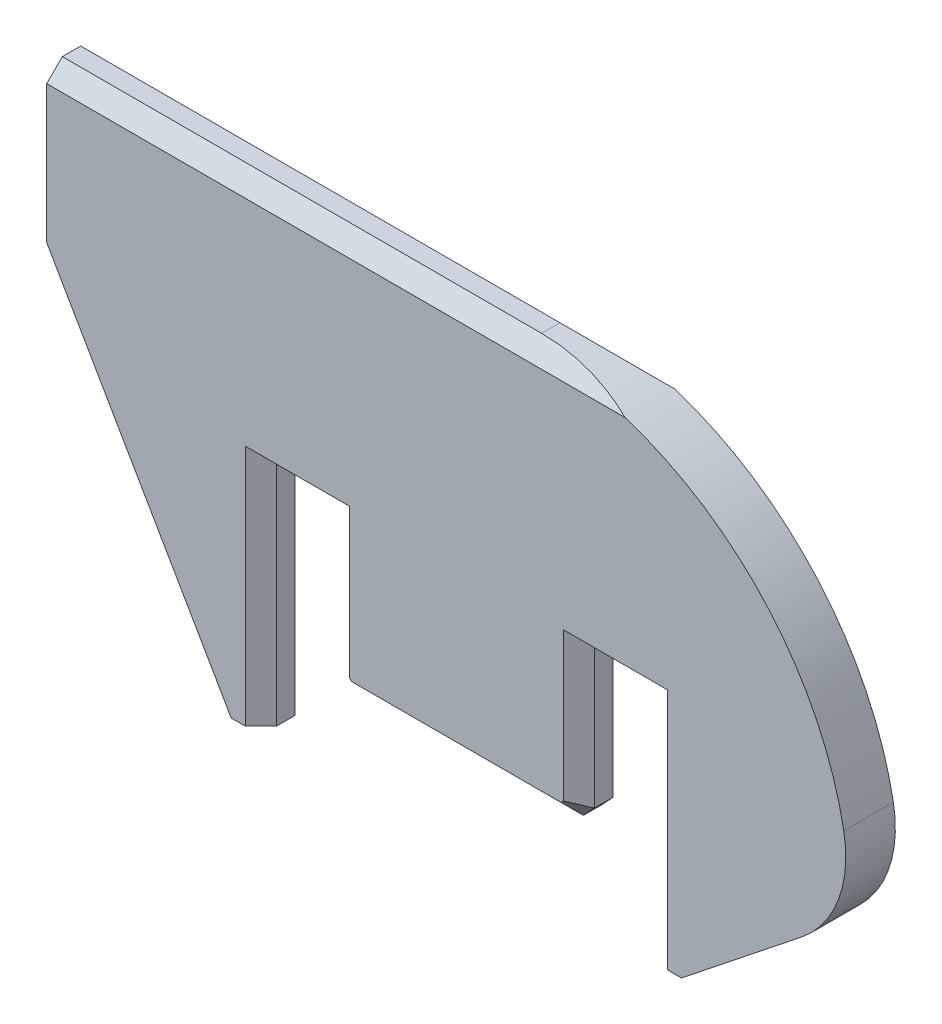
ISO-10303-21;
HEADER;
FILE_DESCRIPTION(('STEP AP214'),'2;1');
FILE_NAME('part.step','',(''),(''),'','','');
FILE_SCHEMA(('AUTOMOTIVE_DESIGN { 1 0 10303 214 1 1 1 1 }'));
ENDSEC;
DATA;
#1=APPLICATION_CONTEXT('core data for automotive mechanical design processes');
#2=APPLICATION_PROTOCOL_DEFINITION('international standard','automotive_design',2000,#1);
#3=PRODUCT_CONTEXT('',#1,'mechanical');
#4=PRODUCT('Part','Part','',(#3));
#5=PRODUCT_RELATED_PRODUCT_CATEGORY('part','',(#4));
#6=PRODUCT_DEFINITION_FORMATION('','',#4);
#7=PRODUCT_DEFINITION_CONTEXT('part definition',#1,'design');
#8=PRODUCT_DEFINITION('design','',#6,#7);
#9=PRODUCT_DEFINITION_SHAPE('','',#8);
#10=(LENGTH_UNIT() NAMED_UNIT(*) SI_UNIT(.MILLI.,.METRE.));
#11=(NAMED_UNIT(*) PLANE_ANGLE_UNIT() SI_UNIT($,.RADIAN.));
#12=(NAMED_UNIT(*) SI_UNIT($,.STERADIAN.) SOLID_ANGLE_UNIT());
#13=UNCERTAINTY_MEASURE_WITH_UNIT(LENGTH_MEASURE(1.E-05),#10,'distance_accuracy_value','');
#14=(GEOMETRIC_REPRESENTATION_CONTEXT(3) GLOBAL_UNCERTAINTY_ASSIGNED_CONTEXT((#13)) GLOBAL_UNIT_ASSIGNED_CONTEXT((#10,
#11,#12)) REPRESENTATION_CONTEXT('',''));
#15=CARTESIAN_POINT('',(0.,0.,0.));
#16=DIRECTION('',(0.,0.,1.));
#17=DIRECTION('',(1.,0.,0.));
#18=AXIS2_PLACEMENT_3D('',#15,#16,#17);
#19=CARTESIAN_POINT('',(-524.878159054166,320.,31.75));
#20=DIRECTION('',(0.,-1.,0.));
#21=DIRECTION('',(1.,0.,0.));
#22=AXIS2_PLACEMENT_3D('',#19,#20,#21);
#23=PLANE('',#22);
#24=DIRECTION('',(0.,0.,1.));
#25=VECTOR('',#24,1.);
#26=CARTESIAN_POINT('',(89.2619135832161,320.,-31.75));
#27=LINE('',#26,#25);
#28=CARTESIAN_POINT('',(89.2619135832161,320.,-11.75));
#29=VERTEX_POINT('',#28);
#30=CARTESIAN_POINT('',(89.2619135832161,320.,11.7499999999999));
#31=VERTEX_POINT('',#30);
#32=EDGE_CURVE('E496',#29,#31,#27,.T.);
#33=ORIENTED_EDGE('',*,*,#32,.F.);
#34=DIRECTION('',(-1.,0.,0.));
#35=VECTOR('',#34,1.);
#36=CARTESIAN_POINT('',(-524.878159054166,320.,-11.75));
#37=LINE('',#36,#35);
#38=CARTESIAN_POINT('',(-524.878159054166,320.,-11.75));
#39=VERTEX_POINT('',#38);
#40=EDGE_CURVE('E479',#29,#39,#37,.T.);
#41=ORIENTED_EDGE('',*,*,#40,.T.);
#42=DIRECTION('',(0.,0.,-1.));
#43=VECTOR('',#42,1.);
#44=CARTESIAN_POINT('',(-524.878159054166,320.,31.75));
#45=LINE('',#44,#43);
#46=CARTESIAN_POINT('',(-524.878159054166,320.,11.7499999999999));
#47=VERTEX_POINT('',#46);
#48=EDGE_CURVE('E506',#47,#39,#45,.T.);
#49=ORIENTED_EDGE('',*,*,#48,.F.);
#50=DIRECTION('',(1.,0.,0.));
#51=VECTOR('',#50,1.);
#52=CARTESIAN_POINT('',(-524.878159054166,320.,11.7499999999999));
#53=LINE('',#52,#51);
#54=EDGE_CURVE('E412',#47,#31,#53,.T.);
#55=ORIENTED_EDGE('',*,*,#54,.T.);
#56=EDGE_LOOP('',(#33,#41,#49,#55));
#57=FACE_BOUND('',#56,.T.);
#58=ADVANCED_FACE('F50',(#57),#23,.F.);
#59=CARTESIAN_POINT('',(0.,0.,31.75));
#60=DIRECTION('',(0.,0.,-1.));
#61=DIRECTION('',(-1.,0.,0.));
#62=AXIS2_PLACEMENT_3D('',#59,#60,#61);
#63=PLANE('',#62);
#64=CARTESIAN_POINT('',(89.2619135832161,-94.2455211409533,31.75));
#65=DIRECTION('',(0.,0.,-1.));
#66=DIRECTION('',(1.,0.,0.));
#67=AXIS2_PLACEMENT_3D('',#64,#65,#66);
#68=CIRCLE('',#67,414.245521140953);
#69=CARTESIAN_POINT('',(216.422524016,300.,31.75));
#70=VERTEX_POINT('',#69);
#71=CARTESIAN_POINT('',(496.537858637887,-18.5774541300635,31.75));
#72=VERTEX_POINT('',#71);
#73=EDGE_CURVE('E444',#70,#72,#68,.T.);
#74=ORIENTED_EDGE('',*,*,#73,.F.);
#75=DIRECTION('',(-1.,0.,0.));
#76=VECTOR('',#75,1.);
#77=CARTESIAN_POINT('',(0.,300.,31.75));
#78=LINE('',#77,#76);
#79=CARTESIAN_POINT('',(-524.878159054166,300.,31.75));
#80=VERTEX_POINT('',#79);
#81=EDGE_CURVE('E11',#70,#80,#78,.T.);
#82=ORIENTED_EDGE('',*,*,#81,.T.);
#83=DIRECTION('',(0.,-1.,0.));
#84=VECTOR('',#83,1.);
#85=CARTESIAN_POINT('',(-524.878159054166,320.,31.75));
#86=LINE('',#85,#84);
#87=CARTESIAN_POINT('',(-524.878159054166,123.60590948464,31.75));
#88=VERTEX_POINT('',#87);
#89=EDGE_CURVE('E241',#80,#88,#86,.T.);
#90=ORIENTED_EDGE('',*,*,#89,.T.);
#91=DIRECTION('',(0.500000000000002,-0.866025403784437,0.));
#92=VECTOR('',#91,1.);
#93=CARTESIAN_POINT('',(-288.496,-285.82,31.75));
#94=LINE('',#93,#92);
#95=CARTESIAN_POINT('',(-288.496,-285.82,31.75));
#96=VERTEX_POINT('',#95);
#97=EDGE_CURVE('E244',#88,#96,#94,.T.);
#98=ORIENTED_EDGE('',*,*,#97,.T.);
#99=DIRECTION('',(1.,0.,0.));
#100=VECTOR('',#99,1.);
#101=CARTESIAN_POINT('',(-250.396,-285.82,31.75));
#102=LINE('',#101,#100);
#103=CARTESIAN_POINT('',(-270.396,-285.82,31.75));
#104=VERTEX_POINT('',#103);
#105=EDGE_CURVE('E262',#96,#104,#102,.T.);
#106=ORIENTED_EDGE('',*,*,#105,.T.);
#107=DIRECTION('',(0.,1.,0.));
#108=VECTOR('',#107,1.);
#109=CARTESIAN_POINT('',(-270.396,0.,31.75));
#110=LINE('',#109,#108);
#111=CARTESIAN_POINT('',(-270.396,24.9999999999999,31.75));
#112=VERTEX_POINT('',#111);
#113=EDGE_CURVE('E389',#104,#112,#110,.T.);
#114=ORIENTED_EDGE('',*,*,#113,.T.);
#115=DIRECTION('',(1.,0.,0.));
#116=VECTOR('',#115,1.);
#117=CARTESIAN_POINT('',(0.,24.9999999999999,31.75));
#118=LINE('',#117,#116);
#119=CARTESIAN_POINT('',(-137.02,24.9999999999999,31.75));
#120=VERTEX_POINT('',#119);
#121=EDGE_CURVE('E384',#112,#120,#118,.T.);
#122=ORIENTED_EDGE('',*,*,#121,.T.);
#123=DIRECTION('',(0.,-1.,0.));
#124=VECTOR('',#123,1.);
#125=CARTESIAN_POINT('',(-137.02,0.,31.75));
#126=LINE('',#125,#124);
#127=CARTESIAN_POINT('',(-137.02,-165.0842563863,31.75));
#128=VERTEX_POINT('',#127);
#129=EDGE_CURVE('E388',#120,#128,#126,.T.);
#130=ORIENTED_EDGE('',*,*,#129,.T.);
#131=DIRECTION('',(0.682728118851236,-0.730672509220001,0.));
#132=VECTOR('',#131,1.);
#133=CARTESIAN_POINT('',(-155.504946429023,-145.301209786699,31.75));
#134=LINE('',#133,#132);
#135=CARTESIAN_POINT('',(-134.09562014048,-168.214,31.75));
#136=VERTEX_POINT('',#135);
#137=EDGE_CURVE('E395',#128,#136,#134,.T.);
#138=ORIENTED_EDGE('',*,*,#137,.T.);
#139=DIRECTION('',(1.,0.,0.));
#140=VECTOR('',#139,1.);
#141=CARTESIAN_POINT('',(0.,-168.214,31.75));
#142=LINE('',#141,#140);
#143=CARTESIAN_POINT('',(134.09562014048,-168.214,31.75));
#144=VERTEX_POINT('',#143);
#145=EDGE_CURVE('E391',#136,#144,#142,.T.);
#146=ORIENTED_EDGE('',*,*,#145,.T.);
#147=DIRECTION('',(0.682728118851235,0.730672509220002,0.));
#148=VECTOR('',#147,1.);
#149=CARTESIAN_POINT('',(155.504946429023,-145.301209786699,31.75));
#150=LINE('',#149,#148);
#151=CARTESIAN_POINT('',(137.02,-165.0842563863,31.75));
#152=VERTEX_POINT('',#151);
#153=EDGE_CURVE('E400',#144,#152,#150,.T.);
#154=ORIENTED_EDGE('',*,*,#153,.T.);
#155=DIRECTION('',(0.,1.,0.));
#156=VECTOR('',#155,1.);
#157=CARTESIAN_POINT('',(137.02,0.,31.75));
#158=LINE('',#157,#156);
#159=CARTESIAN_POINT('',(137.02,25.,31.75));
#160=VERTEX_POINT('',#159);
#161=EDGE_CURVE('E402',#152,#160,#158,.T.);
#162=ORIENTED_EDGE('',*,*,#161,.T.);
#163=DIRECTION('',(1.,0.,0.));
#164=VECTOR('',#163,1.);
#165=CARTESIAN_POINT('',(0.,24.9999999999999,31.75));
#166=LINE('',#165,#164);
#167=CARTESIAN_POINT('',(270.396,25.,31.75));
#168=VERTEX_POINT('',#167);
#169=EDGE_CURVE('E404',#160,#168,#166,.T.);
#170=ORIENTED_EDGE('',*,*,#169,.T.);
#171=DIRECTION('',(0.,-1.,0.));
#172=VECTOR('',#171,1.);
#173=CARTESIAN_POINT('',(270.396,0.,31.75));
#174=LINE('',#173,#172);
#175=CARTESIAN_POINT('',(270.396,-285.82,31.75));
#176=VERTEX_POINT('',#175);
#177=EDGE_CURVE('E406',#168,#176,#174,.T.);
#178=ORIENTED_EDGE('',*,*,#177,.T.);
#179=DIRECTION('',(1.,0.,0.));
#180=VECTOR('',#179,1.);
#181=CARTESIAN_POINT('',(250.396,-285.82,31.75));
#182=LINE('',#181,#180);
#183=CARTESIAN_POINT('',(288.496,-285.82,31.75));
#184=VERTEX_POINT('',#183);
#185=EDGE_CURVE('E620',#176,#184,#182,.T.);
#186=ORIENTED_EDGE('',*,*,#185,.T.);
#187=DIRECTION('',(0.782608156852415,0.622514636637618,0.));
#188=VECTOR('',#187,1.);
#189=CARTESIAN_POINT('',(288.496,-285.82,31.75));
#190=LINE('',#189,#188);
#191=CARTESIAN_POINT('',(442.438766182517,-163.368394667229,31.75));
#192=VERTEX_POINT('',#191);
#193=EDGE_CURVE('E519',#184,#192,#190,.T.);
#194=ORIENTED_EDGE('',*,*,#193,.T.);
#195=CARTESIAN_POINT('',(349.061570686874,-45.9771711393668,31.75));
#196=DIRECTION('',(0.,0.,-1.));
#197=DIRECTION('',(-1.,0.,0.));
#198=AXIS2_PLACEMENT_3D('',#195,#196,#197);
#199=CIRCLE('',#198,150.);
#200=EDGE_CURVE('E271',#192,#72,#199,.F.);
#201=ORIENTED_EDGE('',*,*,#200,.T.);
#202=EDGE_LOOP('',(#74,#82,#90,#98,#106,#114,#122,#130,#138,#146,#154,#162,#170,#178,#186,#194,#201));
#203=FACE_BOUND('',#202,.T.);
#204=ADVANCED_FACE('F243',(#203),#63,.F.);
#205=CARTESIAN_POINT('',(0.,0.,-31.75));
#206=DIRECTION('',(0.,0.,-1.));
#207=DIRECTION('',(-1.,0.,0.));
#208=AXIS2_PLACEMENT_3D('',#205,#206,#207);
#209=PLANE('',#208);
#210=DIRECTION('',(0.,-1.,0.));
#211=VECTOR('',#210,1.);
#212=CARTESIAN_POINT('',(-524.878159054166,320.,-31.75));
#213=LINE('',#212,#211);
#214=CARTESIAN_POINT('',(-524.878159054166,300.,-31.75));
#215=VERTEX_POINT('',#214);
#216=CARTESIAN_POINT('',(-524.878159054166,123.60590948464,-31.75));
#217=VERTEX_POINT('',#216);
#218=EDGE_CURVE('E261',#215,#217,#213,.T.);
#219=ORIENTED_EDGE('',*,*,#218,.F.);
#220=DIRECTION('',(1.,0.,0.));
#221=VECTOR('',#220,1.);
#222=CARTESIAN_POINT('',(89.2619135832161,300.,-31.75));
#223=LINE('',#222,#221);
#224=CARTESIAN_POINT('',(216.422524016,300.,-31.75));
#225=VERTEX_POINT('',#224);
#226=EDGE_CURVE('E74',#215,#225,#223,.T.);
#227=ORIENTED_EDGE('',*,*,#226,.T.);
#228=CARTESIAN_POINT('',(89.2619135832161,-94.2455211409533,-31.75));
#229=DIRECTION('',(0.,0.,-1.));
#230=DIRECTION('',(1.,0.,0.));
#231=AXIS2_PLACEMENT_3D('',#228,#229,#230);
#232=CIRCLE('',#231,414.245521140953);
#233=CARTESIAN_POINT('',(496.537858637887,-18.5774541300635,-31.75));
#234=VERTEX_POINT('',#233);
#235=EDGE_CURVE('E500',#225,#234,#232,.T.);
#236=ORIENTED_EDGE('',*,*,#235,.T.);
#237=CARTESIAN_POINT('',(349.061570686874,-45.9771711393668,-31.75));
#238=DIRECTION('',(0.,0.,-1.));
#239=DIRECTION('',(-1.,0.,0.));
#240=AXIS2_PLACEMENT_3D('',#237,#238,#239);
#241=CIRCLE('',#240,150.);
#242=CARTESIAN_POINT('',(442.438766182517,-163.368394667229,-31.75));
#243=VERTEX_POINT('',#242);
#244=EDGE_CURVE('E287',#234,#243,#241,.T.);
#245=ORIENTED_EDGE('',*,*,#244,.T.);
#246=DIRECTION('',(0.782608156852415,0.622514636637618,0.));
#247=VECTOR('',#246,1.);
#248=CARTESIAN_POINT('',(288.496,-285.82,-31.75));
#249=LINE('',#248,#247);
#250=CARTESIAN_POINT('',(288.496,-285.82,-31.75));
#251=VERTEX_POINT('',#250);
#252=EDGE_CURVE('E252',#251,#243,#249,.T.);
#253=ORIENTED_EDGE('',*,*,#252,.F.);
#254=DIRECTION('',(1.,0.,0.));
#255=VECTOR('',#254,1.);
#256=CARTESIAN_POINT('',(250.396,-285.82,-31.75));
#257=LINE('',#256,#255);
#258=CARTESIAN_POINT('',(270.396,-285.82,-31.75));
#259=VERTEX_POINT('',#258);
#260=EDGE_CURVE('E525',#259,#251,#257,.T.);
#261=ORIENTED_EDGE('',*,*,#260,.F.);
#262=DIRECTION('',(0.,1.,0.));
#263=VECTOR('',#262,1.);
#264=CARTESIAN_POINT('',(270.396,5.00000000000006,-31.75));
#265=LINE('',#264,#263);
#266=CARTESIAN_POINT('',(270.396,25.0000000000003,-31.75));
#267=VERTEX_POINT('',#266);
#268=EDGE_CURVE('E327',#259,#267,#265,.T.);
#269=ORIENTED_EDGE('',*,*,#268,.T.);
#270=DIRECTION('',(-1.,0.,0.));
#271=VECTOR('',#270,1.);
#272=CARTESIAN_POINT('',(157.02,25.0000000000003,-31.75));
#273=LINE('',#272,#271);
#274=CARTESIAN_POINT('',(137.02,25.0000000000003,-31.75));
#275=VERTEX_POINT('',#274);
#276=EDGE_CURVE('E325',#267,#275,#273,.T.);
#277=ORIENTED_EDGE('',*,*,#276,.T.);
#278=DIRECTION('',(0.,-1.,0.));
#279=VECTOR('',#278,1.);
#280=CARTESIAN_POINT('',(137.02,-172.974,-31.75));
#281=LINE('',#280,#279);
#282=CARTESIAN_POINT('',(137.02,-165.0842563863,-31.75));
#283=VERTEX_POINT('',#282);
#284=EDGE_CURVE('E318',#275,#283,#281,.T.);
#285=ORIENTED_EDGE('',*,*,#284,.T.);
#286=DIRECTION('',(-0.682728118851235,-0.730672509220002,0.));
#287=VECTOR('',#286,1.);
#288=CARTESIAN_POINT('',(128.1665498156,-174.559437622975,-31.75));
#289=LINE('',#288,#287);
#290=CARTESIAN_POINT('',(134.09562014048,-168.214,-31.75));
#291=VERTEX_POINT('',#290);
#292=EDGE_CURVE('E320',#283,#291,#289,.T.);
#293=ORIENTED_EDGE('',*,*,#292,.T.);
#294=DIRECTION('',(-1.,0.,0.));
#295=VECTOR('',#294,1.);
#296=CARTESIAN_POINT('',(-142.78,-168.214,-31.75));
#297=LINE('',#296,#295);
#298=CARTESIAN_POINT('',(-134.09562014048,-168.214,-31.75));
#299=VERTEX_POINT('',#298);
#300=EDGE_CURVE('E313',#291,#299,#297,.T.);
#301=ORIENTED_EDGE('',*,*,#300,.T.);
#302=DIRECTION('',(-0.682728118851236,0.730672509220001,0.));
#303=VECTOR('',#302,1.);
#304=CARTESIAN_POINT('',(-142.4065498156,-159.319437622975,-31.75));
#305=LINE('',#304,#303);
#306=CARTESIAN_POINT('',(-137.02,-165.0842563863,-31.75));
#307=VERTEX_POINT('',#306);
#308=EDGE_CURVE('E311',#299,#307,#305,.T.);
#309=ORIENTED_EDGE('',*,*,#308,.T.);
#310=DIRECTION('',(0.,1.,0.));
#311=VECTOR('',#310,1.);
#312=CARTESIAN_POINT('',(-137.02,5.,-31.75));
#313=LINE('',#312,#311);
#314=CARTESIAN_POINT('',(-137.02,25.0000000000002,-31.75));
#315=VERTEX_POINT('',#314);
#316=EDGE_CURVE('E308',#307,#315,#313,.T.);
#317=ORIENTED_EDGE('',*,*,#316,.T.);
#318=DIRECTION('',(-1.,0.,0.));
#319=VECTOR('',#318,1.);
#320=CARTESIAN_POINT('',(-250.396,25.0000000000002,-31.75));
#321=LINE('',#320,#319);
#322=CARTESIAN_POINT('',(-270.396,25.0000000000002,-31.75));
#323=VERTEX_POINT('',#322);
#324=EDGE_CURVE('E304',#315,#323,#321,.T.);
#325=ORIENTED_EDGE('',*,*,#324,.T.);
#326=DIRECTION('',(0.,-1.,0.));
#327=VECTOR('',#326,1.);
#328=CARTESIAN_POINT('',(-270.396,-285.82,-31.75));
#329=LINE('',#328,#327);
#330=CARTESIAN_POINT('',(-270.396,-285.82,-31.75));
#331=VERTEX_POINT('',#330);
#332=EDGE_CURVE('E305',#323,#331,#329,.T.);
#333=ORIENTED_EDGE('',*,*,#332,.T.);
#334=DIRECTION('',(1.,0.,0.));
#335=VECTOR('',#334,1.);
#336=CARTESIAN_POINT('',(-250.396,-285.82,-31.75));
#337=LINE('',#336,#335);
#338=CARTESIAN_POINT('',(-288.496,-285.82,-31.75));
#339=VERTEX_POINT('',#338);
#340=EDGE_CURVE('E514',#339,#331,#337,.T.);
#341=ORIENTED_EDGE('',*,*,#340,.F.);
#342=DIRECTION('',(0.500000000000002,-0.866025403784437,0.));
#343=VECTOR('',#342,1.);
#344=CARTESIAN_POINT('',(-288.496,-285.82,-31.75));
#345=LINE('',#344,#343);
#346=EDGE_CURVE('E508',#217,#339,#345,.T.);
#347=ORIENTED_EDGE('',*,*,#346,.F.);
#348=EDGE_LOOP('',(#219,#227,#236,#245,#253,#261,#269,#277,#285,#293,#301,#309,#317,#325,#333,
#341,#347));
#349=FACE_BOUND('',#348,.T.);
#350=ADVANCED_FACE('F510',(#349),#209,.T.);
#351=CARTESIAN_POINT('',(-524.878159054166,320.,31.75));
#352=DIRECTION('',(1.,0.,0.));
#353=DIRECTION('',(0.,0.,-1.));
#354=AXIS2_PLACEMENT_3D('',#351,#352,#353);
#355=PLANE('',#354);
#356=ORIENTED_EDGE('',*,*,#48,.T.);
#357=DIRECTION('',(0.,-0.70710678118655,-0.707106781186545));
#358=VECTOR('',#357,1.);
#359=CARTESIAN_POINT('',(-524.878159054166,320.,-11.75));
#360=LINE('',#359,#358);
#361=EDGE_CURVE('E488',#39,#215,#360,.T.);
#362=ORIENTED_EDGE('',*,*,#361,.T.);
#363=ORIENTED_EDGE('',*,*,#218,.T.);
#364=DIRECTION('',(0.,0.,-1.));
#365=VECTOR('',#364,1.);
#366=CARTESIAN_POINT('',(-524.878159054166,123.60590948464,31.75));
#367=LINE('',#366,#365);
#368=EDGE_CURVE('E259',#88,#217,#367,.T.);
#369=ORIENTED_EDGE('',*,*,#368,.F.);
#370=ORIENTED_EDGE('',*,*,#89,.F.);
#371=DIRECTION('',(0.,-0.707106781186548,0.707106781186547));
#372=VECTOR('',#371,1.);
#373=CARTESIAN_POINT('',(-524.878159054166,300.,31.75));
#374=LINE('',#373,#372);
#375=EDGE_CURVE('E485',#80,#47,#374,.F.);
#376=ORIENTED_EDGE('',*,*,#375,.T.);
#377=EDGE_LOOP('',(#356,#362,#363,#369,#370,#376));
#378=FACE_BOUND('',#377,.T.);
#379=ADVANCED_FACE('F264',(#378),#355,.F.);
#380=CARTESIAN_POINT('',(-288.496,-285.82,31.75));
#381=DIRECTION('',(0.866025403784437,0.500000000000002,0.));
#382=DIRECTION('',(-0.500000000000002,0.866025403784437,0.));
#383=AXIS2_PLACEMENT_3D('',#380,#381,#382);
#384=PLANE('',#383);
#385=ORIENTED_EDGE('',*,*,#346,.T.);
#386=DIRECTION('',(0.,0.,-1.));
#387=VECTOR('',#386,1.);
#388=CARTESIAN_POINT('',(-288.496,-285.82,31.75));
#389=LINE('',#388,#387);
#390=EDGE_CURVE('E260',#96,#339,#389,.T.);
#391=ORIENTED_EDGE('',*,*,#390,.F.);
#392=ORIENTED_EDGE('',*,*,#97,.F.);
#393=ORIENTED_EDGE('',*,*,#368,.T.);
#394=EDGE_LOOP('',(#385,#391,#392,#393));
#395=FACE_BOUND('',#394,.T.);
#396=ADVANCED_FACE('F253',(#395),#384,.F.);
#397=CARTESIAN_POINT('',(-250.396,-285.82,31.75));
#398=DIRECTION('',(0.,1.,0.));
#399=DIRECTION('',(0.,0.,1.));
#400=AXIS2_PLACEMENT_3D('',#397,#398,#399);
#401=PLANE('',#400);
#402=ORIENTED_EDGE('',*,*,#340,.T.);
#403=DIRECTION('',(0.707106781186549,0.,0.707106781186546));
#404=VECTOR('',#403,1.);
#405=CARTESIAN_POINT('',(-250.396,-285.82,-11.7499999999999));
#406=LINE('',#405,#404);
#407=CARTESIAN_POINT('',(-250.396,-285.82,-11.7499999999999));
#408=VERTEX_POINT('',#407);
#409=EDGE_CURVE('E379',#331,#408,#406,.T.);
#410=ORIENTED_EDGE('',*,*,#409,.T.);
#411=DIRECTION('',(0.,0.,-1.));
#412=VECTOR('',#411,1.);
#413=CARTESIAN_POINT('',(-250.396,-285.82,31.75));
#414=LINE('',#413,#412);
#415=CARTESIAN_POINT('',(-250.396,-285.82,11.7500000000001));
#416=VERTEX_POINT('',#415);
#417=EDGE_CURVE('E273',#416,#408,#414,.T.);
#418=ORIENTED_EDGE('',*,*,#417,.F.);
#419=DIRECTION('',(0.707106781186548,0.,-0.707106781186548));
#420=VECTOR('',#419,1.);
#421=CARTESIAN_POINT('',(-270.396,-285.82,31.75));
#422=LINE('',#421,#420);
#423=EDGE_CURVE('E380',#416,#104,#422,.F.);
#424=ORIENTED_EDGE('',*,*,#423,.T.);
#425=ORIENTED_EDGE('',*,*,#105,.F.);
#426=ORIENTED_EDGE('',*,*,#390,.T.);
#427=EDGE_LOOP('',(#402,#410,#418,#424,#425,#426));
#428=FACE_BOUND('',#427,.T.);
#429=ADVANCED_FACE('F617',(#428),#401,.F.);
#430=CARTESIAN_POINT('',(-250.396,-285.82,31.75));
#431=DIRECTION('',(-1.,0.,0.));
#432=DIRECTION('',(0.,0.,1.));
#433=AXIS2_PLACEMENT_3D('',#430,#431,#432);
#434=PLANE('',#433);
#435=ORIENTED_EDGE('',*,*,#417,.T.);
#436=DIRECTION('',(0.,1.,0.));
#437=VECTOR('',#436,1.);
#438=CARTESIAN_POINT('',(-250.396,5.,-11.7499999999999));
#439=LINE('',#438,#437);
#440=CARTESIAN_POINT('',(-250.396,5.,-11.7499999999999));
#441=VERTEX_POINT('',#440);
#442=EDGE_CURVE('E372',#408,#441,#439,.T.);
#443=ORIENTED_EDGE('',*,*,#442,.T.);
#444=DIRECTION('',(0.,0.,-1.));
#445=VECTOR('',#444,1.);
#446=CARTESIAN_POINT('',(-250.396,5.,31.75));
#447=LINE('',#446,#445);
#448=CARTESIAN_POINT('',(-250.396,5.,11.7500000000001));
#449=VERTEX_POINT('',#448);
#450=EDGE_CURVE('E566',#449,#441,#447,.T.);
#451=ORIENTED_EDGE('',*,*,#450,.F.);
#452=DIRECTION('',(0.,-1.,0.));
#453=VECTOR('',#452,1.);
#454=CARTESIAN_POINT('',(-250.396,-285.82,11.7500000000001));
#455=LINE('',#454,#453);
#456=EDGE_CURVE('E371',#449,#416,#455,.T.);
#457=ORIENTED_EDGE('',*,*,#456,.T.);
#458=EDGE_LOOP('',(#435,#443,#451,#457));
#459=FACE_BOUND('',#458,.T.);
#460=ADVANCED_FACE('F573',(#459),#434,.F.);
#461=CARTESIAN_POINT('',(-250.396,5.,31.75));
#462=DIRECTION('',(0.,1.,0.));
#463=DIRECTION('',(0.,0.,1.));
#464=AXIS2_PLACEMENT_3D('',#461,#462,#463);
#465=PLANE('',#464);
#466=ORIENTED_EDGE('',*,*,#450,.T.);
#467=DIRECTION('',(1.,0.,0.));
#468=VECTOR('',#467,1.);
#469=CARTESIAN_POINT('',(-157.02,5.,-11.7499999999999));
#470=LINE('',#469,#468);
#471=CARTESIAN_POINT('',(-157.02,5.,-11.7499999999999));
#472=VERTEX_POINT('',#471);
#473=EDGE_CURVE('E368',#441,#472,#470,.T.);
#474=ORIENTED_EDGE('',*,*,#473,.T.);
#475=DIRECTION('',(0.,0.,-1.));
#476=VECTOR('',#475,1.);
#477=CARTESIAN_POINT('',(-157.02,5.,31.75));
#478=LINE('',#477,#476);
#479=CARTESIAN_POINT('',(-157.02,5.,11.7500000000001));
#480=VERTEX_POINT('',#479);
#481=EDGE_CURVE('E565',#480,#472,#478,.T.);
#482=ORIENTED_EDGE('',*,*,#481,.F.);
#483=DIRECTION('',(-1.,0.,0.));
#484=VECTOR('',#483,1.);
#485=CARTESIAN_POINT('',(-250.396,5.,11.7500000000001));
#486=LINE('',#485,#484);
#487=EDGE_CURVE('E362',#480,#449,#486,.T.);
#488=ORIENTED_EDGE('',*,*,#487,.T.);
#489=EDGE_LOOP('',(#466,#474,#482,#488));
#490=FACE_BOUND('',#489,.T.);
#491=ADVANCED_FACE('F594',(#490),#465,.F.);
#492=CARTESIAN_POINT('',(-157.02,-172.974,31.75));
#493=DIRECTION('',(1.,0.,0.));
#494=DIRECTION('',(0.,0.,-1.));
#495=AXIS2_PLACEMENT_3D('',#492,#493,#494);
#496=PLANE('',#495);
#497=ORIENTED_EDGE('',*,*,#481,.T.);
#498=DIRECTION('',(0.,-1.,0.));
#499=VECTOR('',#498,1.);
#500=CARTESIAN_POINT('',(-157.02,-172.974,-11.7499999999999));
#501=LINE('',#500,#499);
#502=CARTESIAN_POINT('',(-157.02,-172.974,-11.7499999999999));
#503=VERTEX_POINT('',#502);
#504=EDGE_CURVE('E365',#472,#503,#501,.T.);
#505=ORIENTED_EDGE('',*,*,#504,.T.);
#506=DIRECTION('',(0.,0.,-1.));
#507=VECTOR('',#506,1.);
#508=CARTESIAN_POINT('',(-157.02,-172.974,31.75));
#509=LINE('',#508,#507);
#510=CARTESIAN_POINT('',(-157.02,-172.974,11.7500000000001));
#511=VERTEX_POINT('',#510);
#512=EDGE_CURVE('E556',#511,#503,#509,.T.);
#513=ORIENTED_EDGE('',*,*,#512,.F.);
#514=DIRECTION('',(0.,1.,0.));
#515=VECTOR('',#514,1.);
#516=CARTESIAN_POINT('',(-157.02,-172.974,11.7500000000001));
#517=LINE('',#516,#515);
#518=EDGE_CURVE('E360',#511,#480,#517,.T.);
#519=ORIENTED_EDGE('',*,*,#518,.T.);
#520=EDGE_LOOP('',(#497,#505,#513,#519));
#521=FACE_BOUND('',#520,.T.);
#522=ADVANCED_FACE('F593',(#521),#496,.F.);
#523=CARTESIAN_POINT('',(-157.02,-172.974,31.75));
#524=DIRECTION('',(0.730672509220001,0.682728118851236,0.));
#525=DIRECTION('',(-0.682728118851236,0.730672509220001,0.));
#526=AXIS2_PLACEMENT_3D('',#523,#524,#525);
#527=PLANE('',#526);
#528=ORIENTED_EDGE('',*,*,#512,.T.);
#529=DIRECTION('',(0.682728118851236,-0.730672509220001,0.));
#530=VECTOR('',#529,1.);
#531=CARTESIAN_POINT('',(-142.78,-188.214,-11.7499999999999));
#532=LINE('',#531,#530);
#533=CARTESIAN_POINT('',(-142.78,-188.214,-11.7499999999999));
#534=VERTEX_POINT('',#533);
#535=EDGE_CURVE('E358',#503,#534,#532,.T.);
#536=ORIENTED_EDGE('',*,*,#535,.T.);
#537=DIRECTION('',(0.,0.,-1.));
#538=VECTOR('',#537,1.);
#539=CARTESIAN_POINT('',(-142.78,-188.214,31.75));
#540=LINE('',#539,#538);
#541=CARTESIAN_POINT('',(-142.78,-188.214,11.7500000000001));
#542=VERTEX_POINT('',#541);
#543=EDGE_CURVE('E555',#542,#534,#540,.T.);
#544=ORIENTED_EDGE('',*,*,#543,.F.);
#545=DIRECTION('',(-0.682728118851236,0.730672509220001,0.));
#546=VECTOR('',#545,1.);
#547=CARTESIAN_POINT('',(-157.02,-172.974,11.7500000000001));
#548=LINE('',#547,#546);
#549=EDGE_CURVE('E355',#542,#511,#548,.T.);
#550=ORIENTED_EDGE('',*,*,#549,.T.);
#551=EDGE_LOOP('',(#528,#536,#544,#550));
#552=FACE_BOUND('',#551,.T.);
#553=ADVANCED_FACE('F712',(#552),#527,.F.);
#554=CARTESIAN_POINT('',(-142.78,-188.214,31.75));
#555=DIRECTION('',(0.,1.,0.));
#556=DIRECTION('',(0.,0.,1.));
#557=AXIS2_PLACEMENT_3D('',#554,#555,#556);
#558=PLANE('',#557);
#559=ORIENTED_EDGE('',*,*,#543,.T.);
#560=DIRECTION('',(1.,0.,0.));
#561=VECTOR('',#560,1.);
#562=CARTESIAN_POINT('',(142.78,-188.214,-11.7499999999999));
#563=LINE('',#562,#561);
#564=CARTESIAN_POINT('',(142.78,-188.214,-11.7499999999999));
#565=VERTEX_POINT('',#564);
#566=EDGE_CURVE('E346',#534,#565,#563,.T.);
#567=ORIENTED_EDGE('',*,*,#566,.T.);
#568=DIRECTION('',(0.,0.,-1.));
#569=VECTOR('',#568,1.);
#570=CARTESIAN_POINT('',(142.78,-188.214,31.75));
#571=LINE('',#570,#569);
#572=CARTESIAN_POINT('',(142.78,-188.214,11.7500000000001));
#573=VERTEX_POINT('',#572);
#574=EDGE_CURVE('E548',#573,#565,#571,.T.);
#575=ORIENTED_EDGE('',*,*,#574,.F.);
#576=DIRECTION('',(-1.,0.,0.));
#577=VECTOR('',#576,1.);
#578=CARTESIAN_POINT('',(-142.78,-188.214,11.7500000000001));
#579=LINE('',#578,#577);
#580=EDGE_CURVE('E350',#573,#542,#579,.T.);
#581=ORIENTED_EDGE('',*,*,#580,.T.);
#582=EDGE_LOOP('',(#559,#567,#575,#581));
#583=FACE_BOUND('',#582,.T.);
#584=ADVANCED_FACE('F714',(#583),#558,.F.);
#585=CARTESIAN_POINT('',(157.02,-172.974,31.75));
#586=DIRECTION('',(-0.730672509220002,0.682728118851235,0.));
#587=DIRECTION('',(-0.682728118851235,-0.730672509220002,0.));
#588=AXIS2_PLACEMENT_3D('',#585,#586,#587);
#589=PLANE('',#588);
#590=ORIENTED_EDGE('',*,*,#574,.T.);
#591=DIRECTION('',(0.682728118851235,0.730672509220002,0.));
#592=VECTOR('',#591,1.);
#593=CARTESIAN_POINT('',(157.02,-172.974,-11.7499999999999));
#594=LINE('',#593,#592);
#595=CARTESIAN_POINT('',(157.02,-172.974,-11.7499999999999));
#596=VERTEX_POINT('',#595);
#597=EDGE_CURVE('E343',#565,#596,#594,.T.);
#598=ORIENTED_EDGE('',*,*,#597,.T.);
#599=DIRECTION('',(0.,0.,-1.));
#600=VECTOR('',#599,1.);
#601=CARTESIAN_POINT('',(157.02,-172.974,31.75));
#602=LINE('',#601,#600);
#603=CARTESIAN_POINT('',(157.02,-172.974,11.7500000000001));
#604=VERTEX_POINT('',#603);
#605=EDGE_CURVE('E547',#604,#596,#602,.T.);
#606=ORIENTED_EDGE('',*,*,#605,.F.);
#607=DIRECTION('',(-0.682728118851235,-0.730672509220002,0.));
#608=VECTOR('',#607,1.);
#609=CARTESIAN_POINT('',(157.02,-172.974,11.7500000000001));
#610=LINE('',#609,#608);
#611=EDGE_CURVE('E344',#604,#573,#610,.T.);
#612=ORIENTED_EDGE('',*,*,#611,.T.);
#613=EDGE_LOOP('',(#590,#598,#606,#612));
#614=FACE_BOUND('',#613,.T.);
#615=ADVANCED_FACE('F710',(#614),#589,.F.);
#616=CARTESIAN_POINT('',(157.02,5.00000000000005,31.75));
#617=DIRECTION('',(-1.,0.,0.));
#618=DIRECTION('',(0.,-1.,0.));
#619=AXIS2_PLACEMENT_3D('',#616,#617,#618);
#620=PLANE('',#619);
#621=ORIENTED_EDGE('',*,*,#605,.T.);
#622=DIRECTION('',(0.,1.,0.));
#623=VECTOR('',#622,1.);
#624=CARTESIAN_POINT('',(157.02,5.00000000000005,-11.7499999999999));
#625=LINE('',#624,#623);
#626=CARTESIAN_POINT('',(157.02,5.00000000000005,-11.7499999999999));
#627=VERTEX_POINT('',#626);
#628=EDGE_CURVE('E336',#596,#627,#625,.T.);
#629=ORIENTED_EDGE('',*,*,#628,.T.);
#630=DIRECTION('',(0.,0.,-1.));
#631=VECTOR('',#630,1.);
#632=CARTESIAN_POINT('',(157.02,5.00000000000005,31.75));
#633=LINE('',#632,#631);
#634=CARTESIAN_POINT('',(157.02,5.00000000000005,11.7500000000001));
#635=VERTEX_POINT('',#634);
#636=EDGE_CURVE('E545',#635,#627,#633,.T.);
#637=ORIENTED_EDGE('',*,*,#636,.F.);
#638=DIRECTION('',(0.,-1.,0.));
#639=VECTOR('',#638,1.);
#640=CARTESIAN_POINT('',(157.02,5.00000000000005,11.7500000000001));
#641=LINE('',#640,#639);
#642=EDGE_CURVE('E333',#635,#604,#641,.T.);
#643=ORIENTED_EDGE('',*,*,#642,.T.);
#644=EDGE_LOOP('',(#621,#629,#637,#643));
#645=FACE_BOUND('',#644,.T.);
#646=ADVANCED_FACE('F702',(#645),#620,.F.);
#647=CARTESIAN_POINT('',(157.02,5.00000000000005,31.75));
#648=DIRECTION('',(0.,1.,0.));
#649=DIRECTION('',(-1.,0.,0.));
#650=AXIS2_PLACEMENT_3D('',#647,#648,#649);
#651=PLANE('',#650);
#652=ORIENTED_EDGE('',*,*,#636,.T.);
#653=DIRECTION('',(1.,0.,0.));
#654=VECTOR('',#653,1.);
#655=CARTESIAN_POINT('',(250.396,5.00000000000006,-11.7499999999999));
#656=LINE('',#655,#654);
#657=CARTESIAN_POINT('',(250.396,5.00000000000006,-11.7499999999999));
#658=VERTEX_POINT('',#657);
#659=EDGE_CURVE('E334',#627,#658,#656,.T.);
#660=ORIENTED_EDGE('',*,*,#659,.T.);
#661=DIRECTION('',(0.,0.,-1.));
#662=VECTOR('',#661,1.);
#663=CARTESIAN_POINT('',(250.396,5.00000000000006,31.75));
#664=LINE('',#663,#662);
#665=CARTESIAN_POINT('',(250.396,5.00000000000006,11.7500000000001));
#666=VERTEX_POINT('',#665);
#667=EDGE_CURVE('E540',#666,#658,#664,.T.);
#668=ORIENTED_EDGE('',*,*,#667,.F.);
#669=DIRECTION('',(-1.,0.,0.));
#670=VECTOR('',#669,1.);
#671=CARTESIAN_POINT('',(157.02,5.00000000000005,11.7500000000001));
#672=LINE('',#671,#670);
#673=EDGE_CURVE('E329',#666,#635,#672,.T.);
#674=ORIENTED_EDGE('',*,*,#673,.T.);
#675=EDGE_LOOP('',(#652,#660,#668,#674));
#676=FACE_BOUND('',#675,.T.);
#677=ADVANCED_FACE('F697',(#676),#651,.F.);
#678=CARTESIAN_POINT('',(250.396,-285.82,31.75));
#679=DIRECTION('',(1.,0.,0.));
#680=DIRECTION('',(0.,0.,-1.));
#681=AXIS2_PLACEMENT_3D('',#678,#679,#680);
#682=PLANE('',#681);
#683=ORIENTED_EDGE('',*,*,#667,.T.);
#684=DIRECTION('',(0.,-1.,0.));
#685=VECTOR('',#684,1.);
#686=CARTESIAN_POINT('',(250.396,-285.82,-11.7499999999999));
#687=LINE('',#686,#685);
#688=CARTESIAN_POINT('',(250.396,-285.82,-11.7499999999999));
#689=VERTEX_POINT('',#688);
#690=EDGE_CURVE('E292',#658,#689,#687,.T.);
#691=ORIENTED_EDGE('',*,*,#690,.T.);
#692=DIRECTION('',(0.,0.,-1.));
#693=VECTOR('',#692,1.);
#694=CARTESIAN_POINT('',(250.396,-285.82,31.75));
#695=LINE('',#694,#693);
#696=CARTESIAN_POINT('',(250.396,-285.82,11.7500000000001));
#697=VERTEX_POINT('',#696);
#698=EDGE_CURVE('E534',#697,#689,#695,.T.);
#699=ORIENTED_EDGE('',*,*,#698,.F.);
#700=DIRECTION('',(0.,1.,0.));
#701=VECTOR('',#700,1.);
#702=CARTESIAN_POINT('',(250.396,-285.82,11.7500000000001));
#703=LINE('',#702,#701);
#704=EDGE_CURVE('E286',#697,#666,#703,.T.);
#705=ORIENTED_EDGE('',*,*,#704,.T.);
#706=EDGE_LOOP('',(#683,#691,#699,#705));
#707=FACE_BOUND('',#706,.T.);
#708=ADVANCED_FACE('F696',(#707),#682,.F.);
#709=CARTESIAN_POINT('',(250.396,-285.82,31.75));
#710=DIRECTION('',(0.,1.,0.));
#711=DIRECTION('',(-1.,0.,0.));
#712=AXIS2_PLACEMENT_3D('',#709,#710,#711);
#713=PLANE('',#712);
#714=ORIENTED_EDGE('',*,*,#698,.T.);
#715=DIRECTION('',(0.707106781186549,0.,-0.707106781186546));
#716=VECTOR('',#715,1.);
#717=CARTESIAN_POINT('',(250.396,-285.82,-11.7499999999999));
#718=LINE('',#717,#716);
#719=EDGE_CURVE('E299',#689,#259,#718,.T.);
#720=ORIENTED_EDGE('',*,*,#719,.T.);
#721=ORIENTED_EDGE('',*,*,#260,.T.);
#722=DIRECTION('',(0.,0.,-1.));
#723=VECTOR('',#722,1.);
#724=CARTESIAN_POINT('',(288.496,-285.82,31.75));
#725=LINE('',#724,#723);
#726=EDGE_CURVE('E528',#184,#251,#725,.T.);
#727=ORIENTED_EDGE('',*,*,#726,.F.);
#728=ORIENTED_EDGE('',*,*,#185,.F.);
#729=DIRECTION('',(0.707106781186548,0.,0.707106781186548));
#730=VECTOR('',#729,1.);
#731=CARTESIAN_POINT('',(270.396,-285.82,31.7500000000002));
#732=LINE('',#731,#730);
#733=EDGE_CURVE('E298',#176,#697,#732,.F.);
#734=ORIENTED_EDGE('',*,*,#733,.T.);
#735=EDGE_LOOP('',(#714,#720,#721,#727,#728,#734));
#736=FACE_BOUND('',#735,.T.);
#737=ADVANCED_FACE('F639',(#736),#713,.F.);
#738=CARTESIAN_POINT('',(288.496,-285.82,31.75));
#739=DIRECTION('',(-0.622514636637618,0.782608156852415,0.));
#740=DIRECTION('',(-0.782608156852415,-0.622514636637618,0.));
#741=AXIS2_PLACEMENT_3D('',#738,#739,#740);
#742=PLANE('',#741);
#743=ORIENTED_EDGE('',*,*,#252,.T.);
#744=DIRECTION('',(0.,0.,1.));
#745=VECTOR('',#744,1.);
#746=CARTESIAN_POINT('',(442.438766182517,-163.368394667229,31.75));
#747=LINE('',#746,#745);
#748=EDGE_CURVE('E270',#243,#192,#747,.T.);
#749=ORIENTED_EDGE('',*,*,#748,.T.);
#750=ORIENTED_EDGE('',*,*,#193,.F.);
#751=ORIENTED_EDGE('',*,*,#726,.T.);
#752=EDGE_LOOP('',(#743,#749,#750,#751));
#753=FACE_BOUND('',#752,.T.);
#754=ADVANCED_FACE('F636',(#753),#742,.F.);
#755=CARTESIAN_POINT('',(89.2619135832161,-94.2455211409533,-31.75));
#756=DIRECTION('',(0.,0.,1.));
#757=DIRECTION('',(1.,0.,0.));
#758=AXIS2_PLACEMENT_3D('',#755,#756,#757);
#759=CYLINDRICAL_SURFACE('',#758,414.245521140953);
#760=ORIENTED_EDGE('',*,*,#235,.F.);
#761=CARTESIAN_POINT('',(89.2619135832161,-94.2455211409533,-425.995521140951));
#762=DIRECTION('',(0.,0.707106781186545,-0.70710678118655));
#763=DIRECTION('',(0.,0.70710678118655,0.707106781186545));
#764=AXIS2_PLACEMENT_3D('',#761,#762,#763);
#765=ELLIPSE('',#764,585.831634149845,414.245521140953);
#766=EDGE_CURVE('E60',#225,#29,#765,.F.);
#767=ORIENTED_EDGE('',*,*,#766,.T.);
#768=ORIENTED_EDGE('',*,*,#32,.T.);
#769=CARTESIAN_POINT('',(89.2619135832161,-94.2455211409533,425.995521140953));
#770=DIRECTION('',(0.,-0.707106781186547,-0.707106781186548));
#771=DIRECTION('',(0.,-0.707106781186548,0.707106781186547));
#772=AXIS2_PLACEMENT_3D('',#769,#770,#771);
#773=ELLIPSE('',#772,585.831634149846,414.245521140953);
#774=EDGE_CURVE('E63',#31,#70,#773,.T.);
#775=ORIENTED_EDGE('',*,*,#774,.T.);
#776=ORIENTED_EDGE('',*,*,#73,.T.);
#777=DIRECTION('',(0.,0.,1.));
#778=VECTOR('',#777,1.);
#779=CARTESIAN_POINT('',(496.537858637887,-18.5774541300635,-31.75));
#780=LINE('',#779,#778);
#781=EDGE_CURVE('E285',#72,#234,#780,.F.);
#782=ORIENTED_EDGE('',*,*,#781,.T.);
#783=EDGE_LOOP('',(#760,#767,#768,#775,#776,#782));
#784=FACE_BOUND('',#783,.T.);
#785=ADVANCED_FACE('F492',(#784),#759,.T.);
#786=CARTESIAN_POINT('',(349.061570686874,-45.9771711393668,-31.75));
#787=DIRECTION('',(0.,0.,1.));
#788=DIRECTION('',(1.,0.,0.));
#789=AXIS2_PLACEMENT_3D('',#786,#787,#788);
#790=CYLINDRICAL_SURFACE('',#789,150.);
#791=ORIENTED_EDGE('',*,*,#244,.F.);
#792=ORIENTED_EDGE('',*,*,#781,.F.);
#793=ORIENTED_EDGE('',*,*,#200,.F.);
#794=ORIENTED_EDGE('',*,*,#748,.F.);
#795=EDGE_LOOP('',(#791,#792,#793,#794));
#796=FACE_BOUND('',#795,.T.);
#797=ADVANCED_FACE('F635',(#796),#790,.T.);
#798=CARTESIAN_POINT('',(-250.396,-285.82,-11.7499999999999));
#799=DIRECTION('',(0.707106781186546,0.,-0.707106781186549));
#800=DIRECTION('',(0.,-1.,0.));
#801=AXIS2_PLACEMENT_3D('',#798,#799,#800);
#802=PLANE('',#801);
#803=ORIENTED_EDGE('',*,*,#409,.F.);
#804=ORIENTED_EDGE('',*,*,#332,.F.);
#805=DIRECTION('',(0.577350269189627,-0.577350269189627,0.577350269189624));
#806=VECTOR('',#805,1.);
#807=CARTESIAN_POINT('',(-250.396,5.,-11.7499999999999));
#808=LINE('',#807,#806);
#809=EDGE_CURVE('E441',#441,#323,#808,.F.);
#810=ORIENTED_EDGE('',*,*,#809,.F.);
#811=ORIENTED_EDGE('',*,*,#442,.F.);
#812=EDGE_LOOP('',(#803,#804,#810,#811));
#813=FACE_BOUND('',#812,.T.);
#814=ADVANCED_FACE('F581',(#813),#802,.T.);
#815=CARTESIAN_POINT('',(-250.396,5.,-11.7499999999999));
#816=DIRECTION('',(0.,-0.707106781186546,-0.707106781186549));
#817=DIRECTION('',(-1.,0.,0.));
#818=AXIS2_PLACEMENT_3D('',#815,#816,#817);
#819=PLANE('',#818);
#820=ORIENTED_EDGE('',*,*,#809,.T.);
#821=ORIENTED_EDGE('',*,*,#324,.F.);
#822=DIRECTION('',(-0.577350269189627,-0.577350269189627,0.577350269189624));
#823=VECTOR('',#822,1.);
#824=CARTESIAN_POINT('',(-216.344666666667,-54.3246666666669,47.5746666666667));
#825=LINE('',#824,#823);
#826=EDGE_CURVE('E440',#472,#315,#825,.F.);
#827=ORIENTED_EDGE('',*,*,#826,.F.);
#828=ORIENTED_EDGE('',*,*,#473,.F.);
#829=EDGE_LOOP('',(#820,#821,#827,#828));
#830=FACE_BOUND('',#829,.T.);
#831=ADVANCED_FACE('F588',(#830),#819,.T.);
#832=CARTESIAN_POINT('',(-157.02,-172.974,-11.7499999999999));
#833=DIRECTION('',(-0.707106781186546,0.,-0.707106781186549));
#834=DIRECTION('',(0.,1.,0.));
#835=AXIS2_PLACEMENT_3D('',#832,#833,#834);
#836=PLANE('',#835);
#837=ORIENTED_EDGE('',*,*,#826,.T.);
#838=ORIENTED_EDGE('',*,*,#316,.F.);
#839=DIRECTION('',(-0.681104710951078,-0.268687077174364,0.681104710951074));
#840=VECTOR('',#839,1.);
#841=CARTESIAN_POINT('',(-157.02,-172.974,-11.7499999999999));
#842=LINE('',#841,#840);
#843=EDGE_CURVE('E433',#503,#307,#842,.F.);
#844=ORIENTED_EDGE('',*,*,#843,.F.);
#845=ORIENTED_EDGE('',*,*,#504,.F.);
#846=EDGE_LOOP('',(#837,#838,#844,#845));
#847=FACE_BOUND('',#846,.T.);
#848=ADVANCED_FACE('F673',(#847),#836,.T.);
#849=CARTESIAN_POINT('',(-157.02,-172.974,-11.7499999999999));
#850=DIRECTION('',(-0.516663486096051,-0.482761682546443,-0.70710678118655));
#851=DIRECTION('',(-0.682728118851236,0.730672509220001,0.));
#852=AXIS2_PLACEMENT_3D('',#849,#850,#851);
#853=PLANE('',#852);
#854=ORIENTED_EDGE('',*,*,#843,.T.);
#855=ORIENTED_EDGE('',*,*,#308,.F.);
#856=DIRECTION('',(-0.293515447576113,-0.675961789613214,0.675961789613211));
#857=VECTOR('',#856,1.);
#858=CARTESIAN_POINT('',(-140.98309910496,-184.07576347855,-15.8882365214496));
#859=LINE('',#858,#857);
#860=EDGE_CURVE('E429',#534,#299,#859,.F.);
#861=ORIENTED_EDGE('',*,*,#860,.F.);
#862=ORIENTED_EDGE('',*,*,#535,.F.);
#863=EDGE_LOOP('',(#854,#855,#861,#862));
#864=FACE_BOUND('',#863,.T.);
#865=ADVANCED_FACE('F668',(#864),#853,.T.);
#866=CARTESIAN_POINT('',(-142.78,-188.214,-11.7499999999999));
#867=DIRECTION('',(0.,-0.707106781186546,-0.707106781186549));
#868=DIRECTION('',(-1.,0.,0.));
#869=AXIS2_PLACEMENT_3D('',#866,#867,#868);
#870=PLANE('',#869);
#871=ORIENTED_EDGE('',*,*,#860,.T.);
#872=ORIENTED_EDGE('',*,*,#300,.F.);
#873=DIRECTION('',(0.293515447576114,-0.675961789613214,0.67596178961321));
#874=VECTOR('',#873,1.);
#875=CARTESIAN_POINT('',(118.178629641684,-131.557403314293,-68.4065966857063));
#876=LINE('',#875,#874);
#877=EDGE_CURVE('E424',#565,#291,#876,.F.);
#878=ORIENTED_EDGE('',*,*,#877,.F.);
#879=ORIENTED_EDGE('',*,*,#566,.F.);
#880=EDGE_LOOP('',(#871,#872,#878,#879));
#881=FACE_BOUND('',#880,.T.);
#882=ADVANCED_FACE('F664',(#881),#870,.T.);
#883=CARTESIAN_POINT('',(157.02,-172.974,-11.7499999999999));
#884=DIRECTION('',(0.516663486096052,-0.482761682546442,-0.70710678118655));
#885=DIRECTION('',(-0.682728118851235,-0.730672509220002,0.));
#886=AXIS2_PLACEMENT_3D('',#883,#884,#885);
#887=PLANE('',#886);
#888=ORIENTED_EDGE('',*,*,#877,.T.);
#889=ORIENTED_EDGE('',*,*,#292,.F.);
#890=DIRECTION('',(0.681104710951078,-0.268687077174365,0.681104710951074));
#891=VECTOR('',#890,1.);
#892=CARTESIAN_POINT('',(157.02,-172.974,-11.7499999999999));
#893=LINE('',#892,#891);
#894=EDGE_CURVE('E423',#596,#283,#893,.F.);
#895=ORIENTED_EDGE('',*,*,#894,.F.);
#896=ORIENTED_EDGE('',*,*,#597,.F.);
#897=EDGE_LOOP('',(#888,#889,#895,#896));
#898=FACE_BOUND('',#897,.T.);
#899=ADVANCED_FACE('F656',(#898),#887,.T.);
#900=CARTESIAN_POINT('',(157.02,5.00000000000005,-11.7499999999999));
#901=DIRECTION('',(0.707106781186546,0.,-0.707106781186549));
#902=DIRECTION('',(0.,-1.,0.));
#903=AXIS2_PLACEMENT_3D('',#900,#901,#902);
#904=PLANE('',#903);
#905=ORIENTED_EDGE('',*,*,#894,.T.);
#906=ORIENTED_EDGE('',*,*,#284,.F.);
#907=DIRECTION('',(0.577350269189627,-0.577350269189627,0.577350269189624));
#908=VECTOR('',#907,1.);
#909=CARTESIAN_POINT('',(157.02,5.00000000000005,-11.7499999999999));
#910=LINE('',#909,#908);
#911=EDGE_CURVE('E417',#627,#275,#910,.F.);
#912=ORIENTED_EDGE('',*,*,#911,.F.);
#913=ORIENTED_EDGE('',*,*,#628,.F.);
#914=EDGE_LOOP('',(#905,#906,#912,#913));
#915=FACE_BOUND('',#914,.T.);
#916=ADVANCED_FACE('F654',(#915),#904,.T.);
#917=CARTESIAN_POINT('',(157.02,5.00000000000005,-11.7499999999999));
#918=DIRECTION('',(0.,-0.707106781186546,-0.707106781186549));
#919=DIRECTION('',(-1.,0.,0.));
#920=AXIS2_PLACEMENT_3D('',#917,#918,#919);
#921=PLANE('',#920);
#922=ORIENTED_EDGE('',*,*,#911,.T.);
#923=ORIENTED_EDGE('',*,*,#276,.F.);
#924=DIRECTION('',(-0.577350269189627,-0.577350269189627,0.577350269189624));
#925=VECTOR('',#924,1.);
#926=CARTESIAN_POINT('',(153.456,-91.9400000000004,85.19));
#927=LINE('',#926,#925);
#928=EDGE_CURVE('E415',#658,#267,#927,.F.);
#929=ORIENTED_EDGE('',*,*,#928,.F.);
#930=ORIENTED_EDGE('',*,*,#659,.F.);
#931=EDGE_LOOP('',(#922,#923,#929,#930));
#932=FACE_BOUND('',#931,.T.);
#933=ADVANCED_FACE('F648',(#932),#921,.T.);
#934=CARTESIAN_POINT('',(250.396,-285.82,-11.7499999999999));
#935=DIRECTION('',(-0.707106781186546,0.,-0.707106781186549));
#936=DIRECTION('',(0.,1.,0.));
#937=AXIS2_PLACEMENT_3D('',#934,#935,#936);
#938=PLANE('',#937);
#939=ORIENTED_EDGE('',*,*,#928,.T.);
#940=ORIENTED_EDGE('',*,*,#268,.F.);
#941=ORIENTED_EDGE('',*,*,#719,.F.);
#942=ORIENTED_EDGE('',*,*,#690,.F.);
#943=EDGE_LOOP('',(#939,#940,#941,#942));
#944=FACE_BOUND('',#943,.T.);
#945=ADVANCED_FACE('F641',(#944),#938,.T.);
#946=CARTESIAN_POINT('',(-270.396,0.,31.75));
#947=DIRECTION('',(-0.707106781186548,0.,-0.707106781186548));
#948=DIRECTION('',(0.,1.,0.));
#949=AXIS2_PLACEMENT_3D('',#946,#947,#948);
#950=PLANE('',#949);
#951=ORIENTED_EDGE('',*,*,#423,.F.);
#952=ORIENTED_EDGE('',*,*,#456,.F.);
#953=DIRECTION('',(0.577350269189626,-0.577350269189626,-0.577350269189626));
#954=VECTOR('',#953,1.);
#955=CARTESIAN_POINT('',(-262.062666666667,16.6666666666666,23.4166666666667));
#956=LINE('',#955,#954);
#957=EDGE_CURVE('E419',#112,#449,#956,.T.);
#958=ORIENTED_EDGE('',*,*,#957,.F.);
#959=ORIENTED_EDGE('',*,*,#113,.F.);
#960=EDGE_LOOP('',(#951,#952,#958,#959));
#961=FACE_BOUND('',#960,.T.);
#962=ADVANCED_FACE('F618',(#961),#950,.F.);
#963=CARTESIAN_POINT('',(0.,24.9999999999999,31.75));
#964=DIRECTION('',(0.,0.707106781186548,-0.707106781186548));
#965=DIRECTION('',(1.,0.,0.));
#966=AXIS2_PLACEMENT_3D('',#963,#964,#965);
#967=PLANE('',#966);
#968=ORIENTED_EDGE('',*,*,#957,.T.);
#969=ORIENTED_EDGE('',*,*,#487,.F.);
#970=DIRECTION('',(0.577350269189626,0.577350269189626,0.577350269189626));
#971=VECTOR('',#970,1.);
#972=CARTESIAN_POINT('',(-145.353333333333,16.6666666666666,23.4166666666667));
#973=LINE('',#972,#971);
#974=EDGE_CURVE('E468',#120,#480,#973,.F.);
#975=ORIENTED_EDGE('',*,*,#974,.F.);
#976=ORIENTED_EDGE('',*,*,#121,.F.);
#977=EDGE_LOOP('',(#968,#969,#975,#976));
#978=FACE_BOUND('',#977,.T.);
#979=ADVANCED_FACE('F611',(#978),#967,.F.);
#980=CARTESIAN_POINT('',(-137.02,0.,31.75));
#981=DIRECTION('',(0.707106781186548,0.,-0.707106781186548));
#982=DIRECTION('',(0.,-1.,0.));
#983=AXIS2_PLACEMENT_3D('',#980,#981,#982);
#984=PLANE('',#983);
#985=ORIENTED_EDGE('',*,*,#974,.T.);
#986=ORIENTED_EDGE('',*,*,#518,.F.);
#987=DIRECTION('',(0.681104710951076,0.268687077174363,0.681104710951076));
#988=VECTOR('',#987,1.);
#989=CARTESIAN_POINT('',(-106.808915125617,-153.166370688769,61.9610848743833));
#990=LINE('',#989,#988);
#991=EDGE_CURVE('E467',#128,#511,#990,.F.);
#992=ORIENTED_EDGE('',*,*,#991,.F.);
#993=ORIENTED_EDGE('',*,*,#129,.F.);
#994=EDGE_LOOP('',(#985,#986,#992,#993));
#995=FACE_BOUND('',#994,.T.);
#996=ADVANCED_FACE('F598',(#995),#984,.F.);
#997=CARTESIAN_POINT('',(-155.504946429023,-145.301209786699,31.75));
#998=DIRECTION('',(0.516663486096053,0.482761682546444,-0.707106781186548));
#999=DIRECTION('',(0.682728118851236,-0.730672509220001,0.));
#1000=AXIS2_PLACEMENT_3D('',#997,#998,#999);
#1001=PLANE('',#1000);
#1002=ORIENTED_EDGE('',*,*,#991,.T.);
#1003=ORIENTED_EDGE('',*,*,#549,.F.);
#1004=DIRECTION('',(0.293515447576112,0.675961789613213,0.675961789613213));
#1005=VECTOR('',#1004,1.);
#1006=CARTESIAN_POINT('',(-131.394044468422,-161.992310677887,37.9716893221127));
#1007=LINE('',#1006,#1005);
#1008=EDGE_CURVE('E464',#136,#542,#1007,.F.);
#1009=ORIENTED_EDGE('',*,*,#1008,.F.);
#1010=ORIENTED_EDGE('',*,*,#137,.F.);
#1011=EDGE_LOOP('',(#1002,#1003,#1009,#1010));
#1012=FACE_BOUND('',#1011,.T.);
#1013=ADVANCED_FACE('F607',(#1012),#1001,.F.);
#1014=CARTESIAN_POINT('',(0.,-168.214,31.75));
#1015=DIRECTION('',(0.,0.707106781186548,-0.707106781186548));
#1016=DIRECTION('',(1.,0.,0.));
#1017=AXIS2_PLACEMENT_3D('',#1014,#1015,#1016);
#1018=PLANE('',#1017);
#1019=ORIENTED_EDGE('',*,*,#1008,.T.);
#1020=ORIENTED_EDGE('',*,*,#580,.F.);
#1021=DIRECTION('',(-0.293515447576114,0.675961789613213,0.675961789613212));
#1022=VECTOR('',#1021,1.);
#1023=CARTESIAN_POINT('',(122.543105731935,-141.608728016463,58.3552719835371));
#1024=LINE('',#1023,#1022);
#1025=EDGE_CURVE('E458',#144,#573,#1024,.F.);
#1026=ORIENTED_EDGE('',*,*,#1025,.F.);
#1027=ORIENTED_EDGE('',*,*,#145,.F.);
#1028=EDGE_LOOP('',(#1019,#1020,#1026,#1027));
#1029=FACE_BOUND('',#1028,.T.);
#1030=ADVANCED_FACE('F802',(#1029),#1018,.F.);
#1031=CARTESIAN_POINT('',(155.504946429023,-145.301209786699,31.75));
#1032=DIRECTION('',(-0.516663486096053,0.482761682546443,-0.707106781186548));
#1033=DIRECTION('',(0.682728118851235,0.730672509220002,0.));
#1034=AXIS2_PLACEMENT_3D('',#1031,#1032,#1033);
#1035=PLANE('',#1034);
#1036=ORIENTED_EDGE('',*,*,#1025,.T.);
#1037=ORIENTED_EDGE('',*,*,#611,.F.);
#1038=DIRECTION('',(-0.681104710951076,0.268687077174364,0.681104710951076));
#1039=VECTOR('',#1038,1.);
#1040=CARTESIAN_POINT('',(141.974856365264,-167.038883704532,26.7951436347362));
#1041=LINE('',#1040,#1039);
#1042=EDGE_CURVE('E453',#152,#604,#1041,.F.);
#1043=ORIENTED_EDGE('',*,*,#1042,.F.);
#1044=ORIENTED_EDGE('',*,*,#153,.F.);
#1045=EDGE_LOOP('',(#1036,#1037,#1043,#1044));
#1046=FACE_BOUND('',#1045,.T.);
#1047=ADVANCED_FACE('F794',(#1046),#1035,.F.);
#1048=CARTESIAN_POINT('',(137.02,0.,31.75));
#1049=DIRECTION('',(-0.707106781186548,0.,-0.707106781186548));
#1050=DIRECTION('',(0.,1.,0.));
#1051=AXIS2_PLACEMENT_3D('',#1048,#1049,#1050);
#1052=PLANE('',#1051);
#1053=ORIENTED_EDGE('',*,*,#1042,.T.);
#1054=ORIENTED_EDGE('',*,*,#642,.F.);
#1055=DIRECTION('',(-0.577350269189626,0.577350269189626,0.577350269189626));
#1056=VECTOR('',#1055,1.);
#1057=CARTESIAN_POINT('',(91.3466666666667,70.6733333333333,77.4233333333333));
#1058=LINE('',#1057,#1056);
#1059=EDGE_CURVE('E448',#160,#635,#1058,.F.);
#1060=ORIENTED_EDGE('',*,*,#1059,.F.);
#1061=ORIENTED_EDGE('',*,*,#161,.F.);
#1062=EDGE_LOOP('',(#1053,#1054,#1060,#1061));
#1063=FACE_BOUND('',#1062,.T.);
#1064=ADVANCED_FACE('F789',(#1063),#1052,.F.);
#1065=CARTESIAN_POINT('',(0.,24.9999999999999,31.75));
#1066=DIRECTION('',(0.,0.707106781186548,-0.707106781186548));
#1067=DIRECTION('',(1.,0.,0.));
#1068=AXIS2_PLACEMENT_3D('',#1065,#1066,#1067);
#1069=PLANE('',#1068);
#1070=ORIENTED_EDGE('',*,*,#1059,.T.);
#1071=ORIENTED_EDGE('',*,*,#673,.F.);
#1072=DIRECTION('',(0.577350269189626,0.577350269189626,0.577350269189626));
#1073=VECTOR('',#1072,1.);
#1074=CARTESIAN_POINT('',(262.062666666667,16.6666666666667,23.4166666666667));
#1075=LINE('',#1074,#1073);
#1076=EDGE_CURVE('E447',#168,#666,#1075,.F.);
#1077=ORIENTED_EDGE('',*,*,#1076,.F.);
#1078=ORIENTED_EDGE('',*,*,#169,.F.);
#1079=EDGE_LOOP('',(#1070,#1071,#1077,#1078));
#1080=FACE_BOUND('',#1079,.T.);
#1081=ADVANCED_FACE('F777',(#1080),#1069,.F.);
#1082=CARTESIAN_POINT('',(270.396,0.,31.75));
#1083=DIRECTION('',(0.707106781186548,0.,-0.707106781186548));
#1084=DIRECTION('',(0.,-1.,0.));
#1085=AXIS2_PLACEMENT_3D('',#1082,#1083,#1084);
#1086=PLANE('',#1085);
#1087=ORIENTED_EDGE('',*,*,#1076,.T.);
#1088=ORIENTED_EDGE('',*,*,#704,.F.);
#1089=ORIENTED_EDGE('',*,*,#733,.F.);
#1090=ORIENTED_EDGE('',*,*,#177,.F.);
#1091=EDGE_LOOP('',(#1087,#1088,#1089,#1090));
#1092=FACE_BOUND('',#1091,.T.);
#1093=ADVANCED_FACE('F771',(#1092),#1086,.F.);
#1094=CARTESIAN_POINT('',(-524.878159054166,320.,-11.75));
#1095=DIRECTION('',(0.,0.707106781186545,-0.70710678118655));
#1096=DIRECTION('',(1.,0.,0.));
#1097=AXIS2_PLACEMENT_3D('',#1094,#1095,#1096);
#1098=PLANE('',#1097);
#1099=ORIENTED_EDGE('',*,*,#766,.F.);
#1100=ORIENTED_EDGE('',*,*,#226,.F.);
#1101=ORIENTED_EDGE('',*,*,#361,.F.);
#1102=ORIENTED_EDGE('',*,*,#40,.F.);
#1103=EDGE_LOOP('',(#1099,#1100,#1101,#1102));
#1104=FACE_BOUND('',#1103,.T.);
#1105=ADVANCED_FACE('F504',(#1104),#1098,.T.);
#1106=CARTESIAN_POINT('',(0.,300.,31.75));
#1107=DIRECTION('',(0.,-0.707106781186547,-0.707106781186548));
#1108=DIRECTION('',(-1.,0.,0.));
#1109=AXIS2_PLACEMENT_3D('',#1106,#1107,#1108);
#1110=PLANE('',#1109);
#1111=ORIENTED_EDGE('',*,*,#774,.F.);
#1112=ORIENTED_EDGE('',*,*,#54,.F.);
#1113=ORIENTED_EDGE('',*,*,#375,.F.);
#1114=ORIENTED_EDGE('',*,*,#81,.F.);
#1115=EDGE_LOOP('',(#1111,#1112,#1113,#1114));
#1116=FACE_BOUND('',#1115,.T.);
#1117=ADVANCED_FACE('F49',(#1116),#1110,.F.);
#1118=CLOSED_SHELL('',(#58,#204,#350,#379,#396,#429,#460,#491,#522,#553,#584,#615,#646,#677,
#708,#737,#754,#785,#797,#814,#831,#848,#865,#882,#899,#916,#933,#945,#962,#979,#996,#1013,
#1030,#1047,#1064,#1081,#1093,#1105,#1117));
#1119=MANIFOLD_SOLID_BREP('B2',#1118);
#1120=ADVANCED_BREP_SHAPE_REPRESENTATION('',(#18,#1119),#14);
#1121=SHAPE_DEFINITION_REPRESENTATION(#9,#1120);
ENDSEC;
END-ISO-10303-21;
